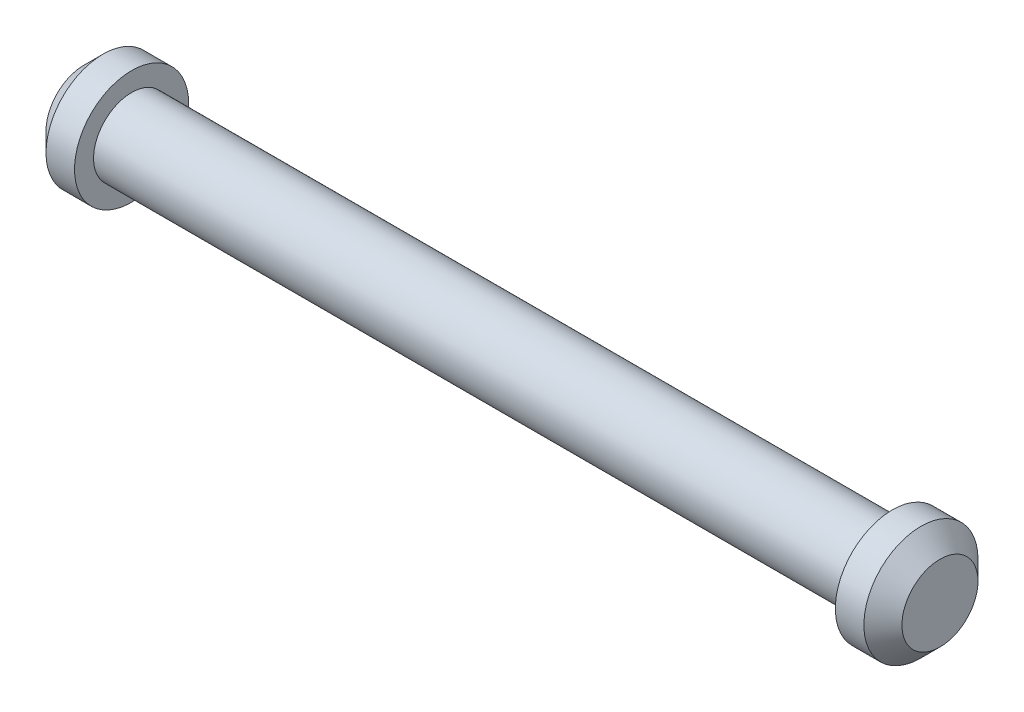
ISO-10303-21;
HEADER;
FILE_DESCRIPTION(('STEP AP214'),'2;1');
FILE_NAME('part.step','',(''),(''),'','','');
FILE_SCHEMA(('AUTOMOTIVE_DESIGN { 1 0 10303 214 1 1 1 1 }'));
ENDSEC;
DATA;
#1=APPLICATION_CONTEXT('core data for automotive mechanical design processes');
#2=APPLICATION_PROTOCOL_DEFINITION('international standard','automotive_design',2000,#1);
#3=PRODUCT_CONTEXT('',#1,'mechanical');
#4=PRODUCT('Part','Part','',(#3));
#5=PRODUCT_RELATED_PRODUCT_CATEGORY('part','',(#4));
#6=PRODUCT_DEFINITION_FORMATION('','',#4);
#7=PRODUCT_DEFINITION_CONTEXT('part definition',#1,'design');
#8=PRODUCT_DEFINITION('design','',#6,#7);
#9=PRODUCT_DEFINITION_SHAPE('','',#8);
#10=(LENGTH_UNIT() NAMED_UNIT(*) SI_UNIT(.MILLI.,.METRE.));
#11=(NAMED_UNIT(*) PLANE_ANGLE_UNIT() SI_UNIT($,.RADIAN.));
#12=(NAMED_UNIT(*) SI_UNIT($,.STERADIAN.) SOLID_ANGLE_UNIT());
#13=UNCERTAINTY_MEASURE_WITH_UNIT(LENGTH_MEASURE(1.E-05),#10,'distance_accuracy_value','');
#14=(GEOMETRIC_REPRESENTATION_CONTEXT(3) GLOBAL_UNCERTAINTY_ASSIGNED_CONTEXT((#13)) GLOBAL_UNIT_ASSIGNED_CONTEXT((#10,
#11,#12)) REPRESENTATION_CONTEXT('',''));
#15=CARTESIAN_POINT('',(0.,0.,0.));
#16=DIRECTION('',(0.,0.,1.));
#17=DIRECTION('',(1.,0.,0.));
#18=AXIS2_PLACEMENT_3D('',#15,#16,#17);
#19=CARTESIAN_POINT('',(40.,0.,0.));
#20=DIRECTION('',(-1.,0.,0.));
#21=DIRECTION('',(0.,0.,1.));
#22=AXIS2_PLACEMENT_3D('',#19,#20,#21);
#23=CYLINDRICAL_SURFACE('',#22,4.);
#24=CARTESIAN_POINT('',(40.,0.,0.));
#25=DIRECTION('',(1.,0.,0.));
#26=DIRECTION('',(0.,0.,-1.));
#27=AXIS2_PLACEMENT_3D('',#24,#25,#26);
#28=CIRCLE('',#27,4.);
#29=CARTESIAN_POINT('',(40.,0.,-4.));
#30=VERTEX_POINT('',#29);
#31=EDGE_CURVE('E73',#30,#30,#28,.T.);
#32=ORIENTED_EDGE('',*,*,#31,.F.);
#33=EDGE_LOOP('',(#32));
#34=FACE_BOUND('',#33,.T.);
#35=CARTESIAN_POINT('',(-40.,0.,0.));
#36=DIRECTION('',(1.,0.,0.));
#37=DIRECTION('',(0.,0.,-1.));
#38=AXIS2_PLACEMENT_3D('',#35,#36,#37);
#39=CIRCLE('',#38,4.);
#40=CARTESIAN_POINT('',(-40.,0.,-4.));
#41=VERTEX_POINT('',#40);
#42=EDGE_CURVE('E74',#41,#41,#39,.T.);
#43=ORIENTED_EDGE('',*,*,#42,.T.);
#44=EDGE_LOOP('',(#43));
#45=FACE_BOUND('',#44,.T.);
#46=ADVANCED_FACE('F47',(#34,#45),#23,.T.);
#47=CARTESIAN_POINT('',(45.,0.,0.));
#48=DIRECTION('',(-1.,0.,0.));
#49=DIRECTION('',(0.,0.,1.));
#50=AXIS2_PLACEMENT_3D('',#47,#48,#49);
#51=CYLINDRICAL_SURFACE('',#50,6.);
#52=CARTESIAN_POINT('',(43.,0.,0.));
#53=DIRECTION('',(1.,0.,0.));
#54=DIRECTION('',(0.,0.,-1.));
#55=AXIS2_PLACEMENT_3D('',#52,#53,#54);
#56=CIRCLE('',#55,6.);
#57=CARTESIAN_POINT('',(43.,0.,-6.));
#58=VERTEX_POINT('',#57);
#59=EDGE_CURVE('E61',#58,#58,#56,.F.);
#60=ORIENTED_EDGE('',*,*,#59,.T.);
#61=EDGE_LOOP('',(#60));
#62=FACE_BOUND('',#61,.T.);
#63=CARTESIAN_POINT('',(40.,0.,0.));
#64=DIRECTION('',(1.,0.,0.));
#65=DIRECTION('',(0.,0.,-1.));
#66=AXIS2_PLACEMENT_3D('',#63,#64,#65);
#67=CIRCLE('',#66,6.);
#68=CARTESIAN_POINT('',(40.,0.,-6.));
#69=VERTEX_POINT('',#68);
#70=EDGE_CURVE('E78',#69,#69,#67,.T.);
#71=ORIENTED_EDGE('',*,*,#70,.T.);
#72=EDGE_LOOP('',(#71));
#73=FACE_BOUND('',#72,.T.);
#74=ADVANCED_FACE('F108',(#62,#73),#51,.T.);
#75=CARTESIAN_POINT('',(45.,0.,0.));
#76=DIRECTION('',(1.,0.,0.));
#77=DIRECTION('',(0.,0.,-1.));
#78=AXIS2_PLACEMENT_3D('',#75,#76,#77);
#79=PLANE('',#78);
#80=CARTESIAN_POINT('',(45.,0.,0.));
#81=DIRECTION('',(1.,0.,0.));
#82=DIRECTION('',(0.,0.,-1.));
#83=AXIS2_PLACEMENT_3D('',#80,#81,#82);
#84=CIRCLE('',#83,4.00000000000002);
#85=CARTESIAN_POINT('',(45.,0.,-4.00000000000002));
#86=VERTEX_POINT('',#85);
#87=EDGE_CURVE('E67',#86,#86,#84,.T.);
#88=ORIENTED_EDGE('',*,*,#87,.T.);
#89=EDGE_LOOP('',(#88));
#90=FACE_BOUND('',#89,.T.);
#91=ADVANCED_FACE('F114',(#90),#79,.T.);
#92=CARTESIAN_POINT('',(40.,0.,0.));
#93=DIRECTION('',(1.,0.,0.));
#94=DIRECTION('',(0.,0.,-1.));
#95=AXIS2_PLACEMENT_3D('',#92,#93,#94);
#96=PLANE('',#95);
#97=ORIENTED_EDGE('',*,*,#31,.T.);
#98=EDGE_LOOP('',(#97));
#99=FACE_BOUND('',#98,.T.);
#100=ORIENTED_EDGE('',*,*,#70,.F.);
#101=EDGE_LOOP('',(#100));
#102=FACE_BOUND('',#101,.T.);
#103=ADVANCED_FACE('F103',(#99,#102),#96,.F.);
#104=CARTESIAN_POINT('',(45.,0.,0.));
#105=DIRECTION('',(-1.,0.,0.));
#106=DIRECTION('',(0.,0.,1.));
#107=AXIS2_PLACEMENT_3D('',#104,#105,#106);
#108=CONICAL_SURFACE('',#107,4.00000000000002,0.785398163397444);
#109=ORIENTED_EDGE('',*,*,#59,.F.);
#110=EDGE_LOOP('',(#109));
#111=FACE_BOUND('',#110,.T.);
#112=ORIENTED_EDGE('',*,*,#87,.F.);
#113=EDGE_LOOP('',(#112));
#114=FACE_BOUND('',#113,.T.);
#115=ADVANCED_FACE('F96',(#111,#114),#108,.T.);
#116=CARTESIAN_POINT('',(-45.,0.,0.));
#117=DIRECTION('',(1.,0.,0.));
#118=DIRECTION('',(0.,0.,-1.));
#119=AXIS2_PLACEMENT_3D('',#116,#117,#118);
#120=CYLINDRICAL_SURFACE('',#119,6.);
#121=CARTESIAN_POINT('',(-43.,0.,0.));
#122=DIRECTION('',(-1.,0.,0.));
#123=DIRECTION('',(0.,0.,1.));
#124=AXIS2_PLACEMENT_3D('',#121,#122,#123);
#125=CIRCLE('',#124,6.);
#126=CARTESIAN_POINT('',(-43.,0.,6.));
#127=VERTEX_POINT('',#126);
#128=EDGE_CURVE('E55',#127,#127,#125,.F.);
#129=ORIENTED_EDGE('',*,*,#128,.T.);
#130=EDGE_LOOP('',(#129));
#131=FACE_BOUND('',#130,.T.);
#132=CARTESIAN_POINT('',(-40.,0.,0.));
#133=DIRECTION('',(1.,0.,0.));
#134=DIRECTION('',(0.,0.,-1.));
#135=AXIS2_PLACEMENT_3D('',#132,#133,#134);
#136=CIRCLE('',#135,6.);
#137=CARTESIAN_POINT('',(-40.,0.,-6.));
#138=VERTEX_POINT('',#137);
#139=EDGE_CURVE('E79',#138,#138,#136,.T.);
#140=ORIENTED_EDGE('',*,*,#139,.F.);
#141=EDGE_LOOP('',(#140));
#142=FACE_BOUND('',#141,.T.);
#143=ADVANCED_FACE('F93',(#131,#142),#120,.T.);
#144=CARTESIAN_POINT('',(-45.,0.,0.));
#145=DIRECTION('',(-1.,0.,0.));
#146=DIRECTION('',(0.,0.,-1.));
#147=AXIS2_PLACEMENT_3D('',#144,#145,#146);
#148=PLANE('',#147);
#149=CARTESIAN_POINT('',(-45.,0.,0.));
#150=DIRECTION('',(-1.,0.,0.));
#151=DIRECTION('',(0.,0.,1.));
#152=AXIS2_PLACEMENT_3D('',#149,#150,#151);
#153=CIRCLE('',#152,3.99999999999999);
#154=CARTESIAN_POINT('',(-45.,0.,3.99999999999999));
#155=VERTEX_POINT('',#154);
#156=EDGE_CURVE('E10',#155,#155,#153,.T.);
#157=ORIENTED_EDGE('',*,*,#156,.T.);
#158=EDGE_LOOP('',(#157));
#159=FACE_BOUND('',#158,.T.);
#160=ADVANCED_FACE('F95',(#159),#148,.T.);
#161=CARTESIAN_POINT('',(-40.,0.,0.));
#162=DIRECTION('',(-1.,0.,0.));
#163=DIRECTION('',(0.,0.,-1.));
#164=AXIS2_PLACEMENT_3D('',#161,#162,#163);
#165=PLANE('',#164);
#166=ORIENTED_EDGE('',*,*,#42,.F.);
#167=EDGE_LOOP('',(#166));
#168=FACE_BOUND('',#167,.T.);
#169=ORIENTED_EDGE('',*,*,#139,.T.);
#170=EDGE_LOOP('',(#169));
#171=FACE_BOUND('',#170,.T.);
#172=ADVANCED_FACE('F91',(#168,#171),#165,.F.);
#173=CARTESIAN_POINT('',(-43.,0.,0.));
#174=DIRECTION('',(1.,0.,0.));
#175=DIRECTION('',(0.,0.,-1.));
#176=AXIS2_PLACEMENT_3D('',#173,#174,#175);
#177=CONICAL_SURFACE('',#176,6.,0.785398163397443);
#178=ORIENTED_EDGE('',*,*,#156,.F.);
#179=EDGE_LOOP('',(#178));
#180=FACE_BOUND('',#179,.T.);
#181=ORIENTED_EDGE('',*,*,#128,.F.);
#182=EDGE_LOOP('',(#181));
#183=FACE_BOUND('',#182,.T.);
#184=ADVANCED_FACE('F49',(#180,#183),#177,.T.);
#185=CLOSED_SHELL('',(#46,#74,#91,#103,#115,#143,#160,#172,#184));
#186=MANIFOLD_SOLID_BREP('B2',#185);
#187=ADVANCED_BREP_SHAPE_REPRESENTATION('',(#18,#186),#14);
#188=SHAPE_DEFINITION_REPRESENTATION(#9,#187);
ENDSEC;
END-ISO-10303-21;
